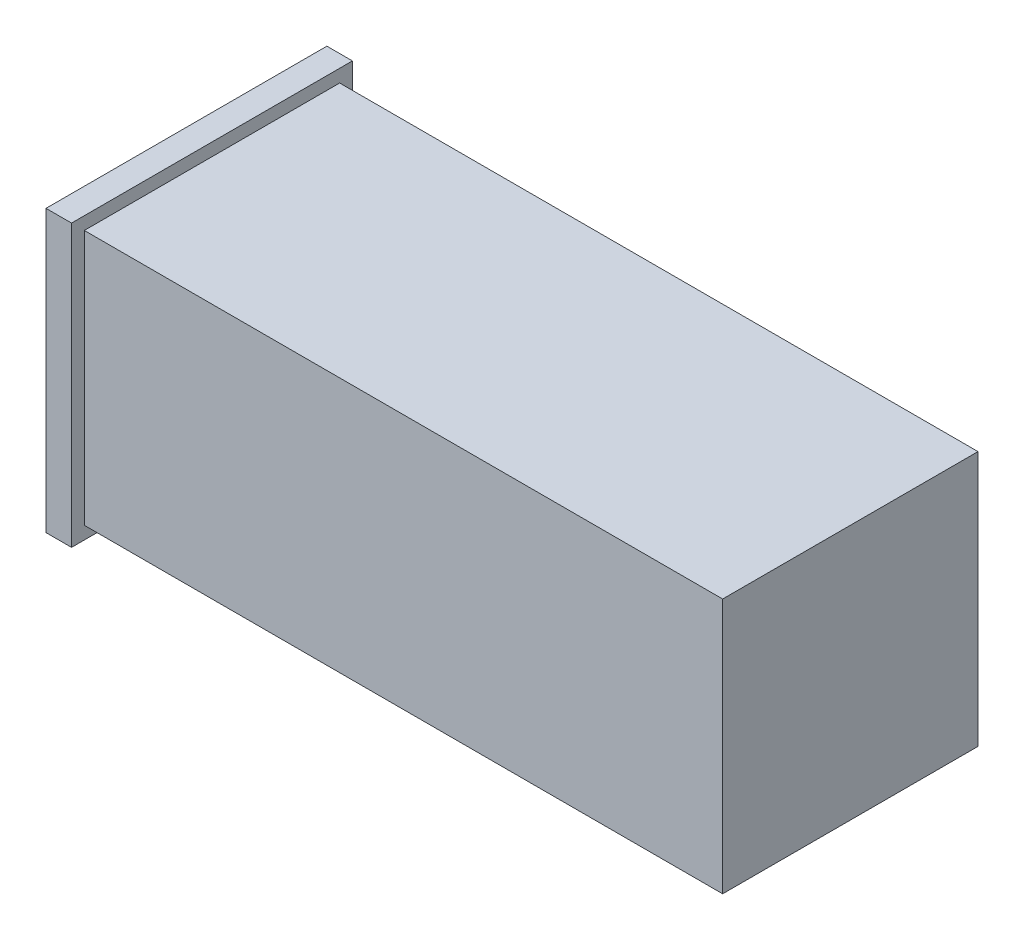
ISO-10303-21;
HEADER;
FILE_DESCRIPTION(('STEP AP214'),'2;1');
FILE_NAME('part.step','',(''),(''),'','','');
FILE_SCHEMA(('AUTOMOTIVE_DESIGN { 1 0 10303 214 1 1 1 1 }'));
ENDSEC;
DATA;
#1=APPLICATION_CONTEXT('core data for automotive mechanical design processes');
#2=APPLICATION_PROTOCOL_DEFINITION('international standard','automotive_design',2000,#1);
#3=PRODUCT_CONTEXT('',#1,'mechanical');
#4=PRODUCT('Part','Part','',(#3));
#5=PRODUCT_RELATED_PRODUCT_CATEGORY('part','',(#4));
#6=PRODUCT_DEFINITION_FORMATION('','',#4);
#7=PRODUCT_DEFINITION_CONTEXT('part definition',#1,'design');
#8=PRODUCT_DEFINITION('design','',#6,#7);
#9=PRODUCT_DEFINITION_SHAPE('','',#8);
#10=(LENGTH_UNIT() NAMED_UNIT(*) SI_UNIT(.MILLI.,.METRE.));
#11=(NAMED_UNIT(*) PLANE_ANGLE_UNIT() SI_UNIT($,.RADIAN.));
#12=(NAMED_UNIT(*) SI_UNIT($,.STERADIAN.) SOLID_ANGLE_UNIT());
#13=UNCERTAINTY_MEASURE_WITH_UNIT(LENGTH_MEASURE(1.E-05),#10,'distance_accuracy_value','');
#14=(GEOMETRIC_REPRESENTATION_CONTEXT(3) GLOBAL_UNCERTAINTY_ASSIGNED_CONTEXT((#13)) GLOBAL_UNIT_ASSIGNED_CONTEXT((#10,
#11,#12)) REPRESENTATION_CONTEXT('',''));
#15=CARTESIAN_POINT('',(0.,0.,0.));
#16=DIRECTION('',(0.,0.,1.));
#17=DIRECTION('',(1.,0.,0.));
#18=AXIS2_PLACEMENT_3D('',#15,#16,#17);
#19=CARTESIAN_POINT('',(0.,-10.9965635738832,100.));
#20=DIRECTION('',(0.,1.,0.));
#21=DIRECTION('',(-1.,0.,0.));
#22=AXIS2_PLACEMENT_3D('',#19,#20,#21);
#23=PLANE('',#22);
#24=DIRECTION('',(1.,0.,0.));
#25=VECTOR('',#24,1.);
#26=CARTESIAN_POINT('',(0.,-10.9965635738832,0.));
#27=LINE('',#26,#25);
#28=CARTESIAN_POINT('',(0.,-10.9965635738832,0.));
#29=VERTEX_POINT('',#28);
#30=CARTESIAN_POINT('',(250.,-10.9965635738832,0.));
#31=VERTEX_POINT('',#30);
#32=EDGE_CURVE('E68',#29,#31,#27,.T.);
#33=ORIENTED_EDGE('',*,*,#32,.T.);
#34=DIRECTION('',(0.,0.,-1.));
#35=VECTOR('',#34,1.);
#36=CARTESIAN_POINT('',(250.,-10.9965635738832,100.));
#37=LINE('',#36,#35);
#38=CARTESIAN_POINT('',(250.,-10.9965635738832,100.));
#39=VERTEX_POINT('',#38);
#40=EDGE_CURVE('E47',#39,#31,#37,.T.);
#41=ORIENTED_EDGE('',*,*,#40,.F.);
#42=DIRECTION('',(1.,0.,0.));
#43=VECTOR('',#42,1.);
#44=CARTESIAN_POINT('',(0.,-10.9965635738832,100.));
#45=LINE('',#44,#43);
#46=CARTESIAN_POINT('',(0.,-10.9965635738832,100.));
#47=VERTEX_POINT('',#46);
#48=EDGE_CURVE('E80',#47,#39,#45,.T.);
#49=ORIENTED_EDGE('',*,*,#48,.F.);
#50=DIRECTION('',(0.,0.,-1.));
#51=VECTOR('',#50,1.);
#52=CARTESIAN_POINT('',(0.,-10.9965635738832,100.));
#53=LINE('',#52,#51);
#54=EDGE_CURVE('E11',#47,#29,#53,.T.);
#55=ORIENTED_EDGE('',*,*,#54,.T.);
#56=EDGE_LOOP('',(#33,#41,#49,#55));
#57=FACE_BOUND('',#56,.T.);
#58=ADVANCED_FACE('F39',(#57),#23,.F.);
#59=CARTESIAN_POINT('',(250.,-10.9965635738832,100.));
#60=DIRECTION('',(-1.,0.,0.));
#61=DIRECTION('',(0.,0.,1.));
#62=AXIS2_PLACEMENT_3D('',#59,#60,#61);
#63=PLANE('',#62);
#64=DIRECTION('',(0.,1.,0.));
#65=VECTOR('',#64,1.);
#66=CARTESIAN_POINT('',(250.,-10.9965635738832,0.));
#67=LINE('',#66,#65);
#68=CARTESIAN_POINT('',(250.,89.0034364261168,0.));
#69=VERTEX_POINT('',#68);
#70=EDGE_CURVE('E75',#31,#69,#67,.T.);
#71=ORIENTED_EDGE('',*,*,#70,.T.);
#72=DIRECTION('',(0.,0.,-1.));
#73=VECTOR('',#72,1.);
#74=CARTESIAN_POINT('',(250.,89.0034364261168,100.));
#75=LINE('',#74,#73);
#76=CARTESIAN_POINT('',(250.,89.0034364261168,100.));
#77=VERTEX_POINT('',#76);
#78=EDGE_CURVE('E157',#77,#69,#75,.T.);
#79=ORIENTED_EDGE('',*,*,#78,.F.);
#80=DIRECTION('',(0.,1.,0.));
#81=VECTOR('',#80,1.);
#82=CARTESIAN_POINT('',(250.,-10.9965635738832,100.));
#83=LINE('',#82,#81);
#84=EDGE_CURVE('E147',#39,#77,#83,.T.);
#85=ORIENTED_EDGE('',*,*,#84,.F.);
#86=ORIENTED_EDGE('',*,*,#40,.T.);
#87=EDGE_LOOP('',(#71,#79,#85,#86));
#88=FACE_BOUND('',#87,.T.);
#89=ADVANCED_FACE('F159',(#88),#63,.F.);
#90=CARTESIAN_POINT('',(0.,89.0034364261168,100.));
#91=DIRECTION('',(0.,-1.,0.));
#92=DIRECTION('',(0.,0.,-1.));
#93=AXIS2_PLACEMENT_3D('',#90,#91,#92);
#94=PLANE('',#93);
#95=DIRECTION('',(-1.,0.,0.));
#96=VECTOR('',#95,1.);
#97=CARTESIAN_POINT('',(0.,89.0034364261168,0.));
#98=LINE('',#97,#96);
#99=CARTESIAN_POINT('',(0.,89.0034364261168,0.));
#100=VERTEX_POINT('',#99);
#101=EDGE_CURVE('E145',#69,#100,#98,.T.);
#102=ORIENTED_EDGE('',*,*,#101,.T.);
#103=DIRECTION('',(0.,0.,-1.));
#104=VECTOR('',#103,1.);
#105=CARTESIAN_POINT('',(0.,89.0034364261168,100.));
#106=LINE('',#105,#104);
#107=CARTESIAN_POINT('',(0.,89.0034364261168,100.));
#108=VERTEX_POINT('',#107);
#109=EDGE_CURVE('E149',#108,#100,#106,.T.);
#110=ORIENTED_EDGE('',*,*,#109,.F.);
#111=DIRECTION('',(-1.,0.,0.));
#112=VECTOR('',#111,1.);
#113=CARTESIAN_POINT('',(0.,89.0034364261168,100.));
#114=LINE('',#113,#112);
#115=EDGE_CURVE('E55',#77,#108,#114,.T.);
#116=ORIENTED_EDGE('',*,*,#115,.F.);
#117=ORIENTED_EDGE('',*,*,#78,.T.);
#118=EDGE_LOOP('',(#102,#110,#116,#117));
#119=FACE_BOUND('',#118,.T.);
#120=ADVANCED_FACE('F164',(#119),#94,.F.);
#121=CARTESIAN_POINT('',(0.,0.,100.));
#122=DIRECTION('',(0.,0.,-1.));
#123=DIRECTION('',(-1.,0.,0.));
#124=AXIS2_PLACEMENT_3D('',#121,#122,#123);
#125=PLANE('',#124);
#126=DIRECTION('',(0.,-1.,0.));
#127=VECTOR('',#126,1.);
#128=CARTESIAN_POINT('',(0.,-10.9965635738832,100.));
#129=LINE('',#128,#127);
#130=EDGE_CURVE('E143',#108,#47,#129,.T.);
#131=ORIENTED_EDGE('',*,*,#130,.T.);
#132=ORIENTED_EDGE('',*,*,#48,.T.);
#133=ORIENTED_EDGE('',*,*,#84,.T.);
#134=ORIENTED_EDGE('',*,*,#115,.T.);
#135=EDGE_LOOP('',(#131,#132,#133,#134));
#136=FACE_BOUND('',#135,.T.);
#137=ADVANCED_FACE('F170',(#136),#125,.F.);
#138=CARTESIAN_POINT('',(0.,0.,0.));
#139=DIRECTION('',(0.,0.,-1.));
#140=DIRECTION('',(-1.,0.,0.));
#141=AXIS2_PLACEMENT_3D('',#138,#139,#140);
#142=PLANE('',#141);
#143=DIRECTION('',(0.,-1.,0.));
#144=VECTOR('',#143,1.);
#145=CARTESIAN_POINT('',(0.,-10.9965635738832,0.));
#146=LINE('',#145,#144);
#147=EDGE_CURVE('E135',#100,#29,#146,.T.);
#148=ORIENTED_EDGE('',*,*,#147,.F.);
#149=ORIENTED_EDGE('',*,*,#101,.F.);
#150=ORIENTED_EDGE('',*,*,#70,.F.);
#151=ORIENTED_EDGE('',*,*,#32,.F.);
#152=EDGE_LOOP('',(#148,#149,#150,#151));
#153=FACE_BOUND('',#152,.T.);
#154=ADVANCED_FACE('F162',(#153),#142,.T.);
#155=CARTESIAN_POINT('',(-10.,-15.9965635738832,105.));
#156=DIRECTION('',(0.,0.,-1.));
#157=DIRECTION('',(-1.,0.,0.));
#158=AXIS2_PLACEMENT_3D('',#155,#156,#157);
#159=PLANE('',#158);
#160=DIRECTION('',(0.,1.,0.));
#161=VECTOR('',#160,1.);
#162=CARTESIAN_POINT('',(0.,-15.9965635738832,105.));
#163=LINE('',#162,#161);
#164=CARTESIAN_POINT('',(0.,-15.9965635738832,105.));
#165=VERTEX_POINT('',#164);
#166=CARTESIAN_POINT('',(0.,94.0034364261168,105.));
#167=VERTEX_POINT('',#166);
#168=EDGE_CURVE('E134',#165,#167,#163,.T.);
#169=ORIENTED_EDGE('',*,*,#168,.T.);
#170=DIRECTION('',(1.,0.,0.));
#171=VECTOR('',#170,1.);
#172=CARTESIAN_POINT('',(-10.,94.0034364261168,105.));
#173=LINE('',#172,#171);
#174=CARTESIAN_POINT('',(-10.,94.0034364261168,105.));
#175=VERTEX_POINT('',#174);
#176=EDGE_CURVE('E114',#175,#167,#173,.T.);
#177=ORIENTED_EDGE('',*,*,#176,.F.);
#178=DIRECTION('',(0.,1.,0.));
#179=VECTOR('',#178,1.);
#180=CARTESIAN_POINT('',(-10.,-15.9965635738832,105.));
#181=LINE('',#180,#179);
#182=CARTESIAN_POINT('',(-10.,-15.9965635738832,105.));
#183=VERTEX_POINT('',#182);
#184=EDGE_CURVE('E121',#183,#175,#181,.T.);
#185=ORIENTED_EDGE('',*,*,#184,.F.);
#186=DIRECTION('',(1.,0.,0.));
#187=VECTOR('',#186,1.);
#188=CARTESIAN_POINT('',(-10.,-15.9965635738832,105.));
#189=LINE('',#188,#187);
#190=EDGE_CURVE('E262',#183,#165,#189,.T.);
#191=ORIENTED_EDGE('',*,*,#190,.T.);
#192=EDGE_LOOP('',(#169,#177,#185,#191));
#193=FACE_BOUND('',#192,.T.);
#194=ADVANCED_FACE('F132',(#193),#159,.F.);
#195=CARTESIAN_POINT('',(-10.,94.0034364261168,-5.));
#196=DIRECTION('',(0.,-1.,0.));
#197=DIRECTION('',(0.,0.,-1.));
#198=AXIS2_PLACEMENT_3D('',#195,#196,#197);
#199=PLANE('',#198);
#200=DIRECTION('',(0.,0.,-1.));
#201=VECTOR('',#200,1.);
#202=CARTESIAN_POINT('',(0.,94.0034364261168,-5.));
#203=LINE('',#202,#201);
#204=CARTESIAN_POINT('',(0.,94.0034364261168,-5.));
#205=VERTEX_POINT('',#204);
#206=EDGE_CURVE('E268',#167,#205,#203,.T.);
#207=ORIENTED_EDGE('',*,*,#206,.T.);
#208=DIRECTION('',(1.,0.,0.));
#209=VECTOR('',#208,1.);
#210=CARTESIAN_POINT('',(-10.,94.0034364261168,-5.));
#211=LINE('',#210,#209);
#212=CARTESIAN_POINT('',(-10.,94.0034364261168,-5.));
#213=VERTEX_POINT('',#212);
#214=EDGE_CURVE('E117',#213,#205,#211,.T.);
#215=ORIENTED_EDGE('',*,*,#214,.F.);
#216=DIRECTION('',(0.,0.,-1.));
#217=VECTOR('',#216,1.);
#218=CARTESIAN_POINT('',(-10.,94.0034364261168,-5.));
#219=LINE('',#218,#217);
#220=EDGE_CURVE('E110',#175,#213,#219,.T.);
#221=ORIENTED_EDGE('',*,*,#220,.F.);
#222=ORIENTED_EDGE('',*,*,#176,.T.);
#223=EDGE_LOOP('',(#207,#215,#221,#222));
#224=FACE_BOUND('',#223,.T.);
#225=ADVANCED_FACE('F112',(#224),#199,.F.);
#226=CARTESIAN_POINT('',(-10.,-15.9965635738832,-4.99999999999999));
#227=DIRECTION('',(0.,0.,1.));
#228=DIRECTION('',(0.,-1.,0.));
#229=AXIS2_PLACEMENT_3D('',#226,#227,#228);
#230=PLANE('',#229);
#231=DIRECTION('',(0.,-1.,0.));
#232=VECTOR('',#231,1.);
#233=CARTESIAN_POINT('',(0.,-15.9965635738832,-4.99999999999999));
#234=LINE('',#233,#232);
#235=CARTESIAN_POINT('',(0.,-15.9965635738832,-4.99999999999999));
#236=VERTEX_POINT('',#235);
#237=EDGE_CURVE('E265',#205,#236,#234,.T.);
#238=ORIENTED_EDGE('',*,*,#237,.T.);
#239=DIRECTION('',(1.,0.,0.));
#240=VECTOR('',#239,1.);
#241=CARTESIAN_POINT('',(-10.,-15.9965635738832,-4.99999999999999));
#242=LINE('',#241,#240);
#243=CARTESIAN_POINT('',(-10.,-15.9965635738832,-4.99999999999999));
#244=VERTEX_POINT('',#243);
#245=EDGE_CURVE('E139',#244,#236,#242,.T.);
#246=ORIENTED_EDGE('',*,*,#245,.F.);
#247=DIRECTION('',(0.,-1.,0.));
#248=VECTOR('',#247,1.);
#249=CARTESIAN_POINT('',(-10.,-15.9965635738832,-4.99999999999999));
#250=LINE('',#249,#248);
#251=EDGE_CURVE('E120',#213,#244,#250,.T.);
#252=ORIENTED_EDGE('',*,*,#251,.F.);
#253=ORIENTED_EDGE('',*,*,#214,.T.);
#254=EDGE_LOOP('',(#238,#246,#252,#253));
#255=FACE_BOUND('',#254,.T.);
#256=ADVANCED_FACE('F222',(#255),#230,.F.);
#257=CARTESIAN_POINT('',(-10.,-15.9965635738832,-4.99999999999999));
#258=DIRECTION('',(0.,1.,0.));
#259=DIRECTION('',(0.,0.,1.));
#260=AXIS2_PLACEMENT_3D('',#257,#258,#259);
#261=PLANE('',#260);
#262=DIRECTION('',(0.,0.,1.));
#263=VECTOR('',#262,1.);
#264=CARTESIAN_POINT('',(0.,-15.9965635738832,-4.99999999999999));
#265=LINE('',#264,#263);
#266=EDGE_CURVE('E130',#236,#165,#265,.T.);
#267=ORIENTED_EDGE('',*,*,#266,.T.);
#268=ORIENTED_EDGE('',*,*,#190,.F.);
#269=DIRECTION('',(0.,0.,1.));
#270=VECTOR('',#269,1.);
#271=CARTESIAN_POINT('',(-10.,-15.9965635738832,-4.99999999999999));
#272=LINE('',#271,#270);
#273=EDGE_CURVE('E126',#244,#183,#272,.T.);
#274=ORIENTED_EDGE('',*,*,#273,.F.);
#275=ORIENTED_EDGE('',*,*,#245,.T.);
#276=EDGE_LOOP('',(#267,#268,#274,#275));
#277=FACE_BOUND('',#276,.T.);
#278=ADVANCED_FACE('F231',(#277),#261,.F.);
#279=CARTESIAN_POINT('',(-10.,0.,0.));
#280=DIRECTION('',(1.,0.,0.));
#281=DIRECTION('',(0.,0.,-1.));
#282=AXIS2_PLACEMENT_3D('',#279,#280,#281);
#283=PLANE('',#282);
#284=ORIENTED_EDGE('',*,*,#184,.T.);
#285=ORIENTED_EDGE('',*,*,#220,.T.);
#286=ORIENTED_EDGE('',*,*,#251,.T.);
#287=ORIENTED_EDGE('',*,*,#273,.T.);
#288=EDGE_LOOP('',(#284,#285,#286,#287));
#289=FACE_BOUND('',#288,.T.);
#290=ADVANCED_FACE('F124',(#289),#283,.F.);
#291=CARTESIAN_POINT('',(0.,0.,0.));
#292=DIRECTION('',(1.,0.,0.));
#293=DIRECTION('',(0.,0.,-1.));
#294=AXIS2_PLACEMENT_3D('',#291,#292,#293);
#295=PLANE('',#294);
#296=ORIENTED_EDGE('',*,*,#109,.T.);
#297=ORIENTED_EDGE('',*,*,#147,.T.);
#298=ORIENTED_EDGE('',*,*,#54,.F.);
#299=ORIENTED_EDGE('',*,*,#130,.F.);
#300=EDGE_LOOP('',(#296,#297,#298,#299));
#301=FACE_BOUND('',#300,.T.);
#302=ORIENTED_EDGE('',*,*,#168,.F.);
#303=ORIENTED_EDGE('',*,*,#266,.F.);
#304=ORIENTED_EDGE('',*,*,#237,.F.);
#305=ORIENTED_EDGE('',*,*,#206,.F.);
#306=EDGE_LOOP('',(#302,#303,#304,#305));
#307=FACE_BOUND('',#306,.T.);
#308=ADVANCED_FACE('F167',(#301,#307),#295,.T.);
#309=CLOSED_SHELL('',(#58,#89,#120,#137,#154,#194,#225,#256,#278,#290,#308));
#310=MANIFOLD_SOLID_BREP('B2',#309);
#311=ADVANCED_BREP_SHAPE_REPRESENTATION('',(#18,#310),#14);
#312=SHAPE_DEFINITION_REPRESENTATION(#9,#311);
ENDSEC;
END-ISO-10303-21;
